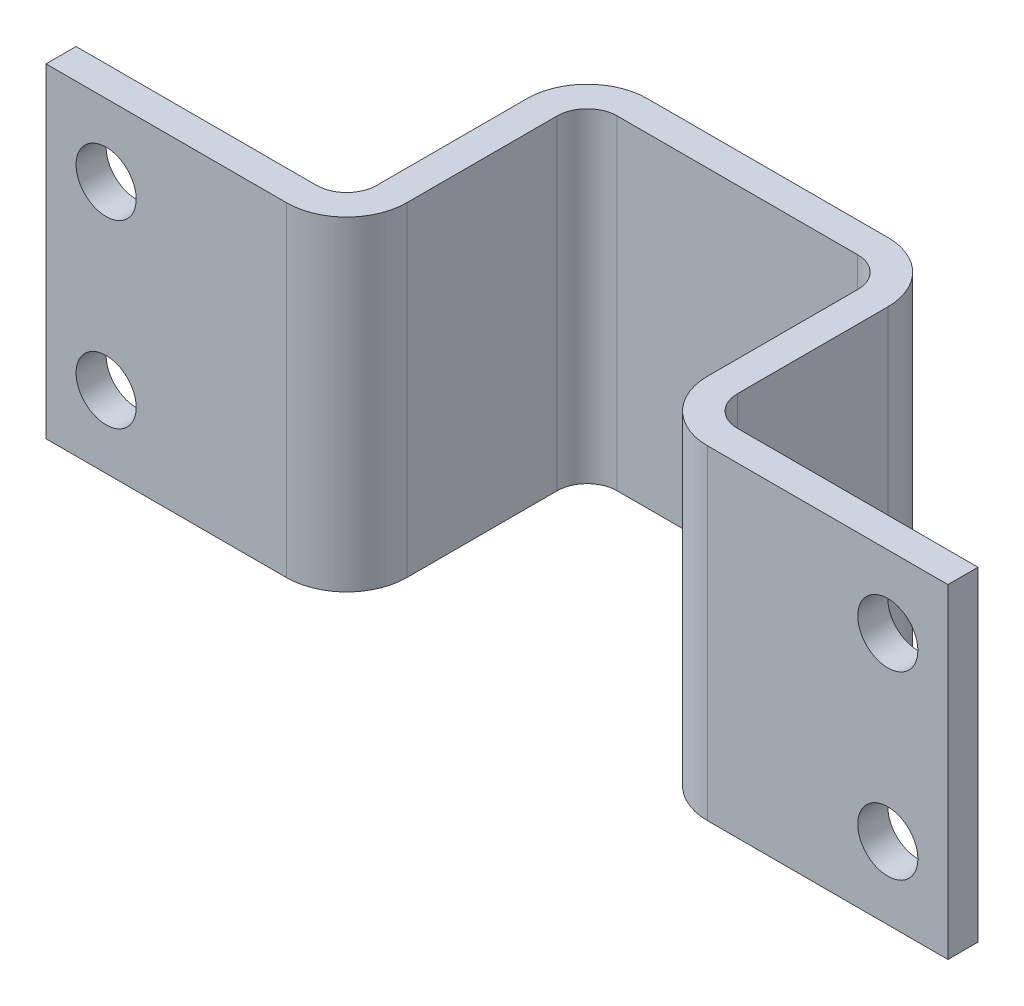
from build123d import *

# Parameters (mm, degrees)
EXTRUDE_THIN1_DEPTH = 54
CUT_EXTRUDE1_REACH  = 104.791
SKETCH2_R           = 5


with BuildPart() as part:
    # Sketch1 → Extrude-Thin1 (new body)
    with BuildSketch(Plane(origin=(0, 0, 0), x_dir=(1, 0, 0), z_dir=(0, 1, 0))):
        with BuildLine():
            Line((-75, 0), (-35, 0))
            ThreePointArc((-35, 0), (-31.464466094, 1.464466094), (-30, 5))
            Line((-30, 5), (-30, 30))
            ThreePointArc((-30, 30), (-27.071067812, 37.071067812), (-20, 40))
            Line((-20, 40), (20, 40))
            ThreePointArc((20, 40), (27.071067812, 37.071067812), (30, 30))
            Line((30, 30), (30, 5))
            ThreePointArc((30, 5), (31.464466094, 1.464466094), (35, 0))
            Line((35, 0), (75, 0))
            Line((75, 0), (75, -5))
            Line((75, -5), (35, -5))
            ThreePointArc((35, -5), (27.928932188, -2.071067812), (25, 5))
            Line((25, 5), (25, 30))
            ThreePointArc((25, 30), (23.535533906, 33.535533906), (20, 35))
            Line((20, 35), (-20, 35))
            ThreePointArc((-20, 35), (-23.535533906, 33.535533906), (-25, 30))
            Line((-25, 30), (-25, 5))
            ThreePointArc((-25, 5), (-27.928932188, -2.071067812), (-35, -5))
            Line((-35, -5), (-75, -5))
            Line((-75, -5), (-75, 0))
        make_face()
    extrude(amount=EXTRUDE_THIN1_DEPTH)

    # Sketch2 → Cut-Extrude1 (cut, up to next)
    with BuildSketch(Plane.XY.offset(5), mode=Mode.PRIVATE) as cut_extrude1_sk1:
        with Locations((65, 42)):
            Circle(SKETCH2_R)
    cut_extrude1_tool1 = extrude(cut_extrude1_sk1.sketch, amount=-CUT_EXTRUDE1_REACH, mode=Mode.PRIVATE) & part.part
    # Sketch2 → Cut-Extrude1 (cut, up to next)
    with BuildSketch(Plane.XY.offset(5), mode=Mode.PRIVATE) as cut_extrude1_sk2:
        with Locations((65, 12)):
            Circle(SKETCH2_R)
    cut_extrude1_tool2 = extrude(cut_extrude1_sk2.sketch, amount=-CUT_EXTRUDE1_REACH, mode=Mode.PRIVATE) & part.part
    # Sketch2 → Cut-Extrude1 (cut, up to next)
    with BuildSketch(Plane.XY.offset(5), mode=Mode.PRIVATE) as cut_extrude1_sk3:
        with Locations(Location((-65, 12, 0), (0, 0, 180))):
            Circle(SKETCH2_R)
    cut_extrude1_tool3 = extrude(cut_extrude1_sk3.sketch, amount=-CUT_EXTRUDE1_REACH, mode=Mode.PRIVATE) & part.part
    # Sketch2 → Cut-Extrude1 (cut, up to next)
    with BuildSketch(Plane.XY.offset(5), mode=Mode.PRIVATE) as cut_extrude1_sk4:
        with Locations(Location((-65, 42, 0), (0, 0, 180))):
            Circle(SKETCH2_R)
    cut_extrude1_tool4 = extrude(cut_extrude1_sk4.sketch, amount=-CUT_EXTRUDE1_REACH, mode=Mode.PRIVATE) & part.part
    add(cut_extrude1_tool1.solids().sort_by_distance((65, 42, 5))[0], mode=Mode.SUBTRACT)
    add(cut_extrude1_tool2.solids().sort_by_distance((65, 12, 5))[0], mode=Mode.SUBTRACT)
    add(cut_extrude1_tool3.solids().sort_by_distance((-65, 12, 5))[0], mode=Mode.SUBTRACT)
    add(cut_extrude1_tool4.solids().sort_by_distance((-65, 42, 5))[0], mode=Mode.SUBTRACT)


solid = part.part
